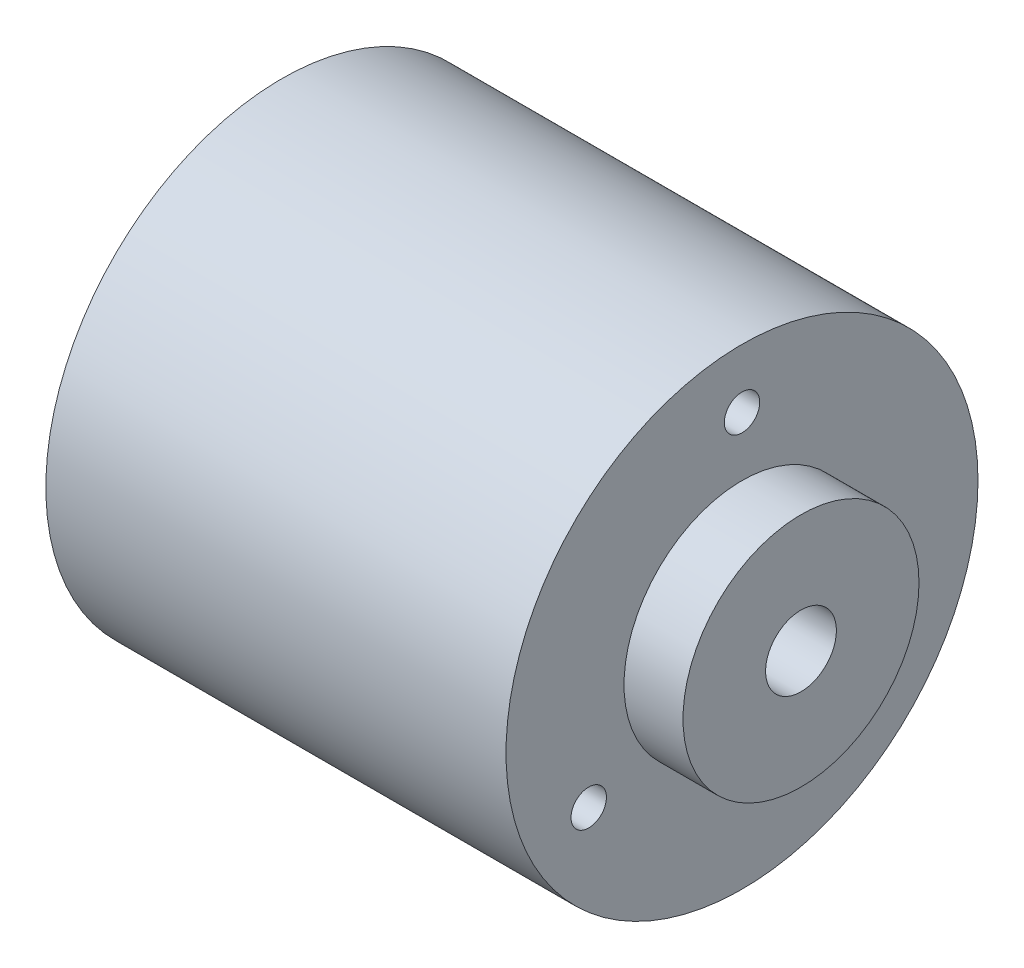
from build123d import *

# Parameters (mm, degrees)
SKETCH1_R                 = 20
BOSS_EXTRUDE1_DEPTH       = 39
SKETCH2_R                 = 10
BOSS_EXTRUDE2_DEPTH       = 5
F_3_0MM_DOWEL_HOLE1_D     = 3
F_3_0MM_DOWEL_HOLE1_DEPTH = 7
F_3_0MM_DOWEL_HOLE1_TIP   = 0.901290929
SKETCH3_R                 = 3
CUT_EXTRUDE2_DEPTH        = 5


with BuildPart() as part:
    # Sketch1 → Boss-Extrude1 (new body)
    with BuildSketch(Plane(origin=(0, 0, 0), x_dir=(0, 0, -1), z_dir=(1, 0, 0))):
        Circle(SKETCH1_R)
    extrude(amount=BOSS_EXTRUDE1_DEPTH)

    # Sketch2 → Boss-Extrude2 (add)
    with BuildSketch(Plane(origin=(39, 0, 0), x_dir=(0, 0, -1), z_dir=(1, 0, 0))):
        Circle(SKETCH2_R)
    extrude(amount=BOSS_EXTRUDE2_DEPTH)

    # 3.0mm Dowel Hole1
    with Locations(Plane(origin=(39, 15, 0), x_dir=(0, 0, 1), z_dir=(1, 0, 0))):
        with Locations((0, 0), (-12.990381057, 22.5), (12.990381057, 22.5)):
            Hole(F_3_0MM_DOWEL_HOLE1_D / 2, depth=F_3_0MM_DOWEL_HOLE1_DEPTH)
            with Locations((0, 0, -(F_3_0MM_DOWEL_HOLE1_DEPTH + F_3_0MM_DOWEL_HOLE1_TIP / 2))):  # 118° drill point
                Cone(0, F_3_0MM_DOWEL_HOLE1_D / 2, F_3_0MM_DOWEL_HOLE1_TIP, mode=Mode.SUBTRACT)

    # Sketch3 → Cut-Extrude2 (cut)
    with BuildSketch(Plane(origin=(44, 0, 0), x_dir=(0, 0, -1), z_dir=(1, 0, 0))):
        Circle(SKETCH3_R)
    extrude(amount=-CUT_EXTRUDE2_DEPTH, mode=Mode.SUBTRACT)


solid = part.part
